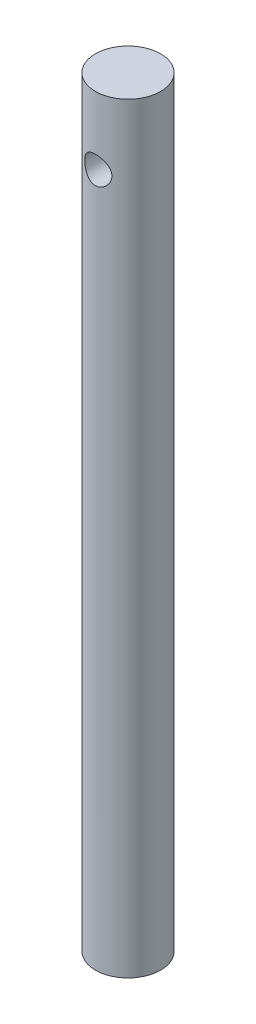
from build123d import *

# Parameters (mm, degrees)
SKETCH1_W               = 6
SKETCH1_H               = 140
CUT_EXTRUDE2_DEPTH      = 141.256907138
CUT_EXTRUDE2_DEPTH_BACK = 141.256907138
SKETCH4_R               = 2.5


with BuildPart() as part:
    # Sketch1 → Revolve1 (revolve)
    with BuildSketch(Plane.XY, mode=Mode.PRIVATE) as revolve1_sk:
        with Locations((-3, 70)):
            Rectangle(SKETCH1_W, SKETCH1_H)
    revolve(revolve1_sk.sketch.rotate(Axis((0, 0, 0), (0, 1, 0)), 270), axis=Axis((0, 0, 0), (0, 1, 0)))

    # Sketch4 → Cut-Extrude2 (cut, two sides: drawn at the far end of the back side and taken through both)
    with BuildSketch(Plane.XY.offset(-CUT_EXTRUDE2_DEPTH_BACK)):
        with Locations((0, 127.5)):
            Circle(SKETCH4_R)
    extrude(amount=CUT_EXTRUDE2_DEPTH + CUT_EXTRUDE2_DEPTH_BACK, mode=Mode.SUBTRACT)


solid = part.part
